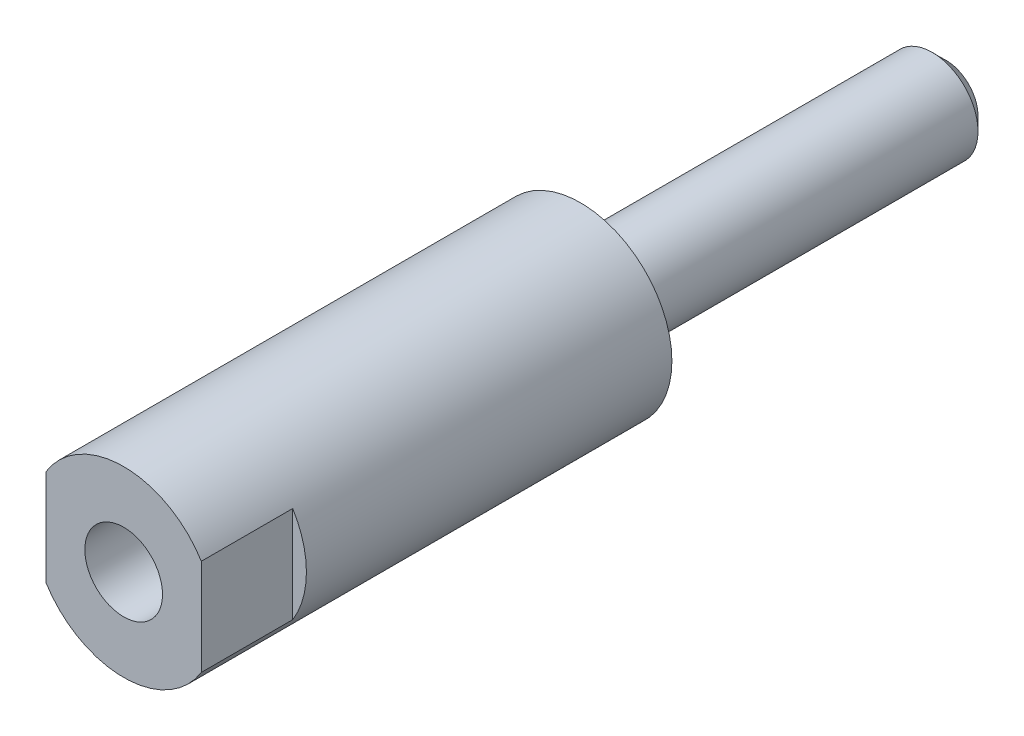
from build123d import *

# Parameters (mm, degrees)
ESQUISSE1_R             = 10
EXTRUSION1_DEPTH        = 50
ESQUISSE2_R             = 5
EXTRUSION2_DEPTH        = 40
TROU_TARAUD_M101_D      = 8.5
TROU_TARAUD_M101_DEPTH  = 35
TROU_TARAUD_M101_TIP    = 2.553657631
ENL_V_START             = -10
ENL_V_MAT_EXTRU_1_DEPTH = 10
CHANFREIN1_SIZE         = 1.5


with BuildPart() as part:
    # Esquisse1 → Extrusion1 (new body)
    with BuildSketch(Plane.XY):
        Circle(ESQUISSE1_R)
    extrude(amount=EXTRUSION1_DEPTH)

    # Esquisse2 → Extrusion2 (add)
    with BuildSketch(Plane(origin=(0, 0, 0), x_dir=(-1, 0, 0), z_dir=(0, 0, -1))):
        with Locations(Location((0, 0, 0), (0, 0, 180))):
            Circle(ESQUISSE2_R)
    extrude(amount=EXTRUSION2_DEPTH)

    # Trou taraud_ M101
    with Locations(Plane.XY.offset(50)):
        with Locations((0, 0)):
            Hole(TROU_TARAUD_M101_D / 2, depth=TROU_TARAUD_M101_DEPTH)
            with Locations((0, 0, -(TROU_TARAUD_M101_DEPTH + TROU_TARAUD_M101_TIP / 2))):  # 118° drill point
                Cone(0, TROU_TARAUD_M101_D / 2, TROU_TARAUD_M101_TIP, mode=Mode.SUBTRACT)

    # Esquisse5 → Enl_v. mat.-Extru.1 (cut)
    with BuildSketch(Plane.XY.offset(50).offset(ENL_V_START)):
        with BuildLine():
            Line((-8.5, 5.267826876), (-8.5, -5.267826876))
            ThreePointArc((-8.5, -5.267826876), (-10, 0), (-8.5, 5.267826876))
        make_face()
        with BuildLine():
            Line((8.5, 5.267826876), (8.5, -5.267826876))
            ThreePointArc((8.5, -5.267826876), (10, 0), (8.5, 5.267826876))
        make_face()
    extrude(amount=ENL_V_MAT_EXTRU_1_DEPTH, mode=Mode.SUBTRACT)

    # Chanfrein1
    chanfrein1_edges = [part.edges().sort_by_distance(p)[0] for p in [
        (-5, 0, -40),
    ]]
    chamfer(chanfrein1_edges, length=CHANFREIN1_SIZE)


solid = part.part
